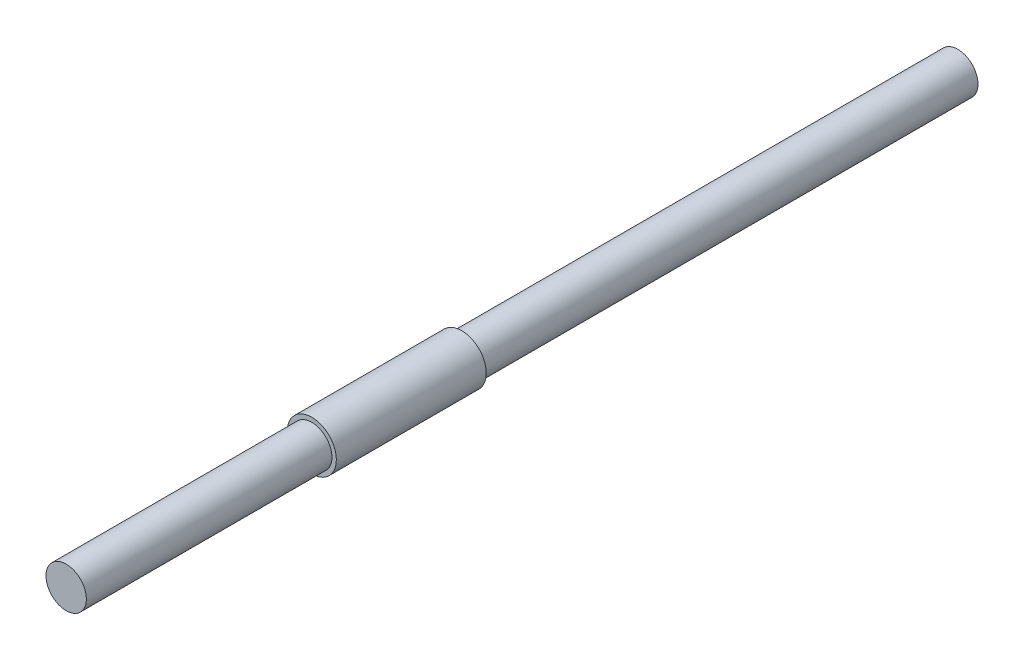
ISO-10303-21;
HEADER;
FILE_DESCRIPTION(('STEP AP214'),'2;1');
FILE_NAME('part.step','',(''),(''),'','','');
FILE_SCHEMA(('AUTOMOTIVE_DESIGN { 1 0 10303 214 1 1 1 1 }'));
ENDSEC;
DATA;
#1=APPLICATION_CONTEXT('core data for automotive mechanical design processes');
#2=APPLICATION_PROTOCOL_DEFINITION('international standard','automotive_design',2000,#1);
#3=PRODUCT_CONTEXT('',#1,'mechanical');
#4=PRODUCT('Part','Part','',(#3));
#5=PRODUCT_RELATED_PRODUCT_CATEGORY('part','',(#4));
#6=PRODUCT_DEFINITION_FORMATION('','',#4);
#7=PRODUCT_DEFINITION_CONTEXT('part definition',#1,'design');
#8=PRODUCT_DEFINITION('design','',#6,#7);
#9=PRODUCT_DEFINITION_SHAPE('','',#8);
#10=(LENGTH_UNIT() NAMED_UNIT(*) SI_UNIT(.MILLI.,.METRE.));
#11=(NAMED_UNIT(*) PLANE_ANGLE_UNIT() SI_UNIT($,.RADIAN.));
#12=(NAMED_UNIT(*) SI_UNIT($,.STERADIAN.) SOLID_ANGLE_UNIT());
#13=UNCERTAINTY_MEASURE_WITH_UNIT(LENGTH_MEASURE(1.E-05),#10,'distance_accuracy_value','');
#14=(GEOMETRIC_REPRESENTATION_CONTEXT(3) GLOBAL_UNCERTAINTY_ASSIGNED_CONTEXT((#13)) GLOBAL_UNIT_ASSIGNED_CONTEXT((#10,
#11,#12)) REPRESENTATION_CONTEXT('',''));
#15=CARTESIAN_POINT('',(0.,0.,0.));
#16=DIRECTION('',(0.,0.,1.));
#17=DIRECTION('',(1.,0.,0.));
#18=AXIS2_PLACEMENT_3D('',#15,#16,#17);
#19=CARTESIAN_POINT('',(44.4499999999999,95.2500000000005,-24.13));
#20=DIRECTION('',(0.,0.,1.));
#21=DIRECTION('',(1.,0.,0.));
#22=AXIS2_PLACEMENT_3D('',#19,#20,#21);
#23=CYLINDRICAL_SURFACE('',#22,1.2999999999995);
#24=CARTESIAN_POINT('',(44.4499999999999,95.2500000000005,-24.13));
#25=DIRECTION('',(0.,0.,1.));
#26=DIRECTION('',(1.,0.,0.));
#27=AXIS2_PLACEMENT_3D('',#24,#25,#26);
#28=CIRCLE('',#27,1.2999999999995);
#29=CARTESIAN_POINT('',(45.7499999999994,95.2500000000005,-24.13));
#30=VERTEX_POINT('',#29);
#31=EDGE_CURVE('E38',#30,#30,#28,.T.);
#32=ORIENTED_EDGE('',*,*,#31,.T.);
#33=EDGE_LOOP('',(#32));
#34=FACE_BOUND('',#33,.T.);
#35=CARTESIAN_POINT('',(44.4499999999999,95.2500000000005,7.81049999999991));
#36=DIRECTION('',(0.,0.,1.));
#37=DIRECTION('',(1.,0.,0.));
#38=AXIS2_PLACEMENT_3D('',#35,#36,#37);
#39=CIRCLE('',#38,1.2999999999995);
#40=CARTESIAN_POINT('',(45.7499999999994,95.2500000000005,7.81049999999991));
#41=VERTEX_POINT('',#40);
#42=EDGE_CURVE('E34',#41,#41,#39,.F.);
#43=ORIENTED_EDGE('',*,*,#42,.T.);
#44=EDGE_LOOP('',(#43));
#45=FACE_BOUND('',#44,.T.);
#46=ADVANCED_FACE('F30',(#34,#45),#23,.T.);
#47=CARTESIAN_POINT('',(44.4499999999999,95.2500000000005,-24.13));
#48=DIRECTION('',(0.,0.,1.));
#49=DIRECTION('',(1.,0.,0.));
#50=AXIS2_PLACEMENT_3D('',#47,#48,#49);
#51=PLANE('',#50);
#52=ORIENTED_EDGE('',*,*,#31,.F.);
#53=EDGE_LOOP('',(#52));
#54=FACE_BOUND('',#53,.T.);
#55=ADVANCED_FACE('F70',(#54),#51,.F.);
#56=CARTESIAN_POINT('',(44.4499999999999,95.2500000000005,7.81049999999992));
#57=DIRECTION('',(0.,0.,1.));
#58=DIRECTION('',(1.,0.,0.));
#59=AXIS2_PLACEMENT_3D('',#56,#57,#58);
#60=CYLINDRICAL_SURFACE('',#59,1.58212493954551);
#61=CARTESIAN_POINT('',(44.4499999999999,95.2500000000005,7.81049999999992));
#62=DIRECTION('',(0.,0.,1.));
#63=DIRECTION('',(1.,0.,0.));
#64=AXIS2_PLACEMENT_3D('',#61,#62,#63);
#65=CIRCLE('',#64,1.58212493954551);
#66=CARTESIAN_POINT('',(46.0321249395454,95.2500000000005,7.81049999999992));
#67=VERTEX_POINT('',#66);
#68=EDGE_CURVE('E50',#67,#67,#65,.T.);
#69=ORIENTED_EDGE('',*,*,#68,.T.);
#70=EDGE_LOOP('',(#69));
#71=FACE_BOUND('',#70,.T.);
#72=CARTESIAN_POINT('',(44.4499999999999,95.2500000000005,17.4624999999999));
#73=DIRECTION('',(0.,0.,1.));
#74=DIRECTION('',(1.,0.,0.));
#75=AXIS2_PLACEMENT_3D('',#72,#73,#74);
#76=CIRCLE('',#75,1.58212493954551);
#77=CARTESIAN_POINT('',(46.0321249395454,95.2500000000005,17.4624999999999));
#78=VERTEX_POINT('',#77);
#79=EDGE_CURVE('E47',#78,#78,#76,.T.);
#80=ORIENTED_EDGE('',*,*,#79,.F.);
#81=EDGE_LOOP('',(#80));
#82=FACE_BOUND('',#81,.T.);
#83=ADVANCED_FACE('F62',(#71,#82),#60,.T.);
#84=CARTESIAN_POINT('',(44.4499999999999,95.2500000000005,7.81049999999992));
#85=DIRECTION('',(0.,0.,1.));
#86=DIRECTION('',(1.,0.,0.));
#87=AXIS2_PLACEMENT_3D('',#84,#85,#86);
#88=PLANE('',#87);
#89=ORIENTED_EDGE('',*,*,#42,.F.);
#90=EDGE_LOOP('',(#89));
#91=FACE_BOUND('',#90,.T.);
#92=ORIENTED_EDGE('',*,*,#68,.F.);
#93=EDGE_LOOP('',(#92));
#94=FACE_BOUND('',#93,.T.);
#95=ADVANCED_FACE('F58',(#91,#94),#88,.F.);
#96=CARTESIAN_POINT('',(44.4499999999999,95.2500000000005,17.4624999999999));
#97=DIRECTION('',(0.,0.,1.));
#98=DIRECTION('',(1.,0.,0.));
#99=AXIS2_PLACEMENT_3D('',#96,#97,#98);
#100=PLANE('',#99);
#101=CARTESIAN_POINT('',(44.4499999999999,95.2500000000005,17.4624999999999));
#102=DIRECTION('',(0.,0.,1.));
#103=DIRECTION('',(1.,0.,0.));
#104=AXIS2_PLACEMENT_3D('',#101,#102,#103);
#105=CIRCLE('',#104,1.2999999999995);
#106=CARTESIAN_POINT('',(45.7499999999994,95.2500000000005,17.4624999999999));
#107=VERTEX_POINT('',#106);
#108=EDGE_CURVE('E10',#107,#107,#105,.F.);
#109=ORIENTED_EDGE('',*,*,#108,.T.);
#110=EDGE_LOOP('',(#109));
#111=FACE_BOUND('',#110,.T.);
#112=ORIENTED_EDGE('',*,*,#79,.T.);
#113=EDGE_LOOP('',(#112));
#114=FACE_BOUND('',#113,.T.);
#115=ADVANCED_FACE('F61',(#111,#114),#100,.T.);
#116=CARTESIAN_POINT('',(44.4499999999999,95.2500000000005,33.274));
#117=DIRECTION('',(0.,0.,1.));
#118=DIRECTION('',(1.,0.,0.));
#119=AXIS2_PLACEMENT_3D('',#116,#117,#118);
#120=PLANE('',#119);
#121=CARTESIAN_POINT('',(44.4499999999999,95.2500000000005,33.274));
#122=DIRECTION('',(0.,0.,1.));
#123=DIRECTION('',(1.,0.,0.));
#124=AXIS2_PLACEMENT_3D('',#121,#122,#123);
#125=CIRCLE('',#124,1.2999999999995);
#126=CARTESIAN_POINT('',(45.7499999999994,95.2500000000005,33.274));
#127=VERTEX_POINT('',#126);
#128=EDGE_CURVE('E42',#127,#127,#125,.T.);
#129=ORIENTED_EDGE('',*,*,#128,.T.);
#130=EDGE_LOOP('',(#129));
#131=FACE_BOUND('',#130,.T.);
#132=ADVANCED_FACE('F68',(#131),#120,.T.);
#133=ORIENTED_EDGE('',*,*,#108,.F.);
#134=EDGE_LOOP('',(#133));
#135=FACE_BOUND('',#134,.T.);
#136=ORIENTED_EDGE('',*,*,#128,.F.);
#137=EDGE_LOOP('',(#136));
#138=FACE_BOUND('',#137,.T.);
#139=ADVANCED_FACE('F32',(#135,#138),#23,.T.);
#140=CLOSED_SHELL('',(#46,#55,#83,#95,#115,#132,#139));
#141=MANIFOLD_SOLID_BREP('B2',#140);
#142=ADVANCED_BREP_SHAPE_REPRESENTATION('',(#18,#141),#14);
#143=SHAPE_DEFINITION_REPRESENTATION(#9,#142);
ENDSEC;
END-ISO-10303-21;
